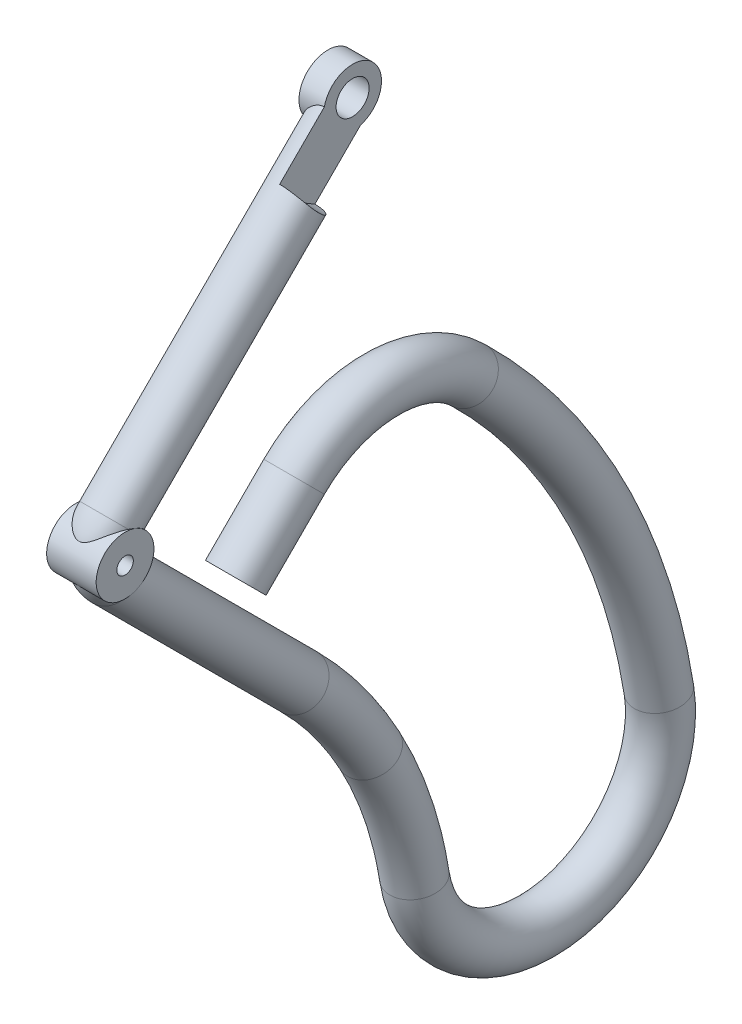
from build123d import *
from build123d.topology import SkipClean

# Parameters (mm, degrees)
SKETCH5_R               = 3
CUT_EXTRUDE1_DEPTH      = 76.027897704
CUT_EXTRUDE1_DEPTH_BACK = 76.027897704
SKETCH4_R               = 1
SKETCH8_R               = 3.5
SKETCH8_R_2             = 1
BOSS_EXTRUDE1_DEPTH     = 3
SKETCH9_R               = 3.5
BOSS_EXTRUDE2_DEPTH     = 3
SKETCH10_R              = 2
CUT_EXTRUDE3_DEPTH      = 76.207615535
SKETCH11_R              = 10
CUT_EXTRUDE4_DEPTH      = 3


with BuildPart() as part:
    # Base-Sweep: sweep along a path in Sketch2
    with BuildLine(Plane(origin=(0, 0, 0), x_dir=(0, 0, -1), z_dir=(1, 0, 0))) as base_sweep_path:
        Line((-4.983394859, 1.443473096), (2.084333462, 8.511201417))
        ThreePointArc((2.084333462, 8.511201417), (12.600525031, 12.90432723), (23.16890931, 8.638287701))
        ThreePointArc((23.16890931, 8.638287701), (38.315176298, -11.798943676), (46.279879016, -35.957862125))
        ThreePointArc((46.279879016, -35.957862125), (33.840507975, -53.141052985), (16.657317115, -40.701681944))
        ThreePointArc((16.657317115, -40.701681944), (11.817234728, -25.870347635), (2.641719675, -13.25270925))
        Line((2.641719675, -13.25270925), (-20.221157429, 9.610167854))
        ThreePointArc((-20.221157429, 9.610167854), (-21.392730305, 12.438594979), (-20.221157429, 15.267022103))
        Line((-20.221157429, 15.267022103), (9.213435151, 44.701614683))
    # Sketch5 → Base-Sweep (sweep)
    with BuildSketch(Plane(origin=(0, 26.957524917, -26.957524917), x_dir=(-1, 0, 0), z_dir=(0, 0.7071067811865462, -0.7071067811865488))):
        with Locations((0, 25.0939324)):
            Circle(SKETCH5_R)
    sweep(path=base_sweep_path.line)

    # Sketch4 → Cut-Extrude1 (cut, two sides: drawn at the far end of the back side and taken through both)
    with BuildSketch(Plane(origin=(0, 0, 0), x_dir=(0, 0, -1), z_dir=(1, 0, 0)).offset(-CUT_EXTRUDE1_DEPTH_BACK)):
        with Locations(Location((-21.390138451, 12.438594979, 0), (0, 0, 317.246838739))):
            Circle(SKETCH4_R)
    extrude(amount=CUT_EXTRUDE1_DEPTH + CUT_EXTRUDE1_DEPTH_BACK, mode=Mode.SUBTRACT)

    # Sketch8 → Boss-Extrude1 (add, symmetric)
    with SkipClean():  # the faces are left unmerged after this step: merging them gives an invalid solid
        with BuildSketch(Plane(origin=(0, 0, 0), x_dir=(0, 0, -1), z_dir=(1, 0, 0))):
            with Locations((-21.390138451, 12.438594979)):
                Circle(SKETCH8_R)
            with Locations((-21.390138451, 12.438594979)):
                Circle(SKETCH8_R_2, mode=Mode.SUBTRACT)
        extrude(amount=BOSS_EXTRUDE1_DEPTH, both=True)

    # Sketch9 → Boss-Extrude2 (add, symmetric)
    with SkipClean():  # the faces are left unmerged after this step: merging them gives an invalid solid
        with BuildSketch(Plane(origin=(0, 0, 0), x_dir=(0, 0, -1), z_dir=(1, 0, 0))):
            with Locations((9.170252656, 44.744797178)):
                Circle(SKETCH9_R)
        extrude(amount=BOSS_EXTRUDE2_DEPTH, both=True)

    # Sketch10 → Cut-Extrude3 (cut, through all)
    with SkipClean():  # the faces are left unmerged after this step: merging them gives an invalid solid
        with BuildSketch(Plane(origin=(3, 0, 0), x_dir=(0, 0, -1), z_dir=(1, 0, 0))):
            with Locations((9.170252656, 44.744797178)):
                Circle(SKETCH10_R)
        extrude(amount=-CUT_EXTRUDE3_DEPTH, mode=Mode.SUBTRACT)

    # Sketch11 → Cut-Extrude4 (cut)
    with SkipClean():  # the faces are left unmerged after this step: merging them gives an invalid solid
        with BuildSketch(Plane(origin=(3, 0, 0), x_dir=(0, 0, -1), z_dir=(1, 0, 0))):
            with Locations((9.170252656, 44.744797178)):
                Circle(SKETCH11_R)
        extrude(amount=-CUT_EXTRUDE4_DEPTH, mode=Mode.SUBTRACT)


solid = part.part
